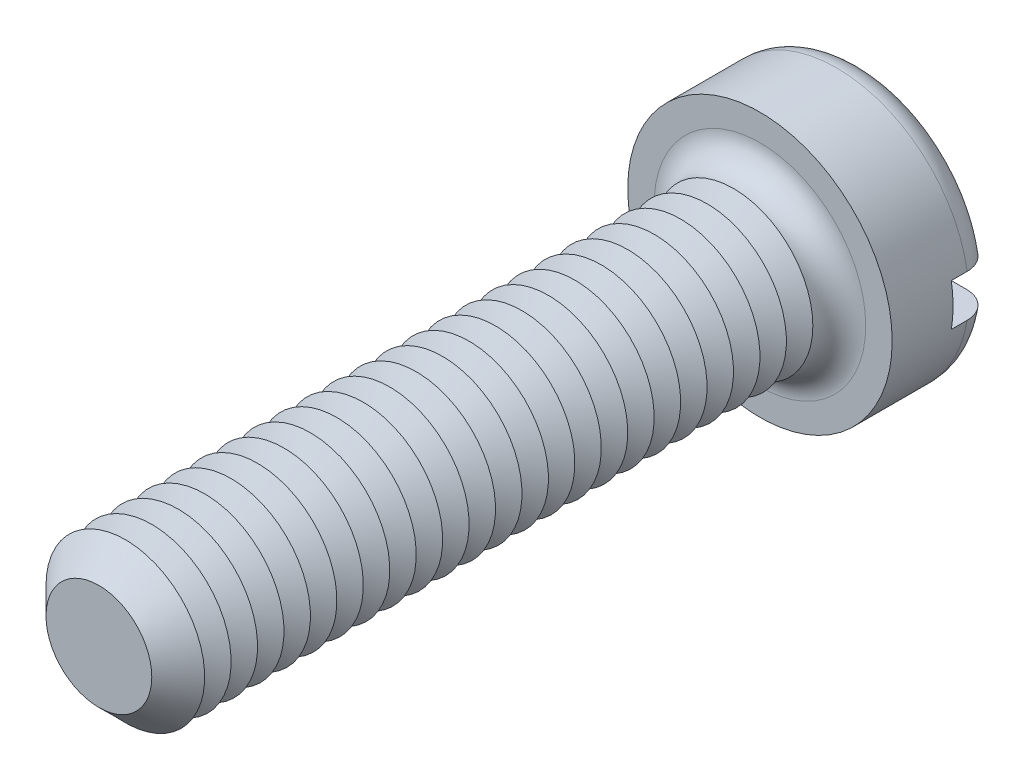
from build123d import *

# Parameters (mm, degrees)
SKETCH3_R           = 5
BOSS_EXTRUDE2_DEPTH = 3.9
SKETCH4_R           = 3
BOSS_EXTRUDE3_DEPTH = 25
FILLET1_R           = 1
CHAMFER1_SIZE       = 1
LPATTERN1_COUNT     = 23
LPATTERN1_PITCH     = 1
SKETCH8_W           = 10
SKETCH8_H           = 1.6
CUT_EXTRUDE1_DEPTH  = 1.6


with BuildPart() as part:
    # Sketch3 → Boss-Extrude2 (new body)
    with BuildSketch(Plane.XY):
        Circle(SKETCH3_R)
    extrude(amount=-BOSS_EXTRUDE2_DEPTH)

    # Sketch4 → Boss-Extrude3 (add)
    with BuildSketch(Plane.XY):
        Circle(SKETCH4_R)
    extrude(amount=BOSS_EXTRUDE3_DEPTH)

    # Fillet1
    fillet1_edges = [part.edges().sort_by_distance(p)[0] for p in [
        (-5, 0, -3.9),
        (-3, 0, 0),
    ]]
    fillet(fillet1_edges, radius=FILLET1_R)

    # Chamfer1
    chamfer1_edges = [part.edges().sort_by_distance(p)[0] for p in [
        (-3, 0, 25),
    ]]
    chamfer(chamfer1_edges, length=CHAMFER1_SIZE)

    # Sketch6 → Cut-Revolve1 (revolve, cut)
    with BuildSketch(Plane(origin=(0, 0, 0), x_dir=(0, 0, -1), z_dir=(1, 0, 0)), mode=Mode.PRIVATE) as cut_revolve1_sk:
        Polygon((-1, 3), (-1.5, 2.133974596), (-2, 3), align=None)
    cut_revolve1 = revolve(cut_revolve1_sk.sketch.rotate(Axis((0, 0, -1.694361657), (0, 0, 1)), 90), axis=Axis((0, 0, -1.694361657), (0, 0, 1)), mode=Mode.SUBTRACT)

    # LPattern1: Cut-Revolve1 ×23
    with Locations(*[(0, 0, i * LPATTERN1_PITCH) for i in range(1, LPATTERN1_COUNT)]):
        add(cut_revolve1, mode=Mode.SUBTRACT)

    # Sketch8 → Cut-Extrude1 (cut)
    with BuildSketch(Plane(origin=(0, 0, -3.9), x_dir=(-1, 0, 0), z_dir=(0, 0, -1))):
        Rectangle(SKETCH8_W, SKETCH8_H)
    extrude(amount=-CUT_EXTRUDE1_DEPTH, mode=Mode.SUBTRACT)


solid = part.part
